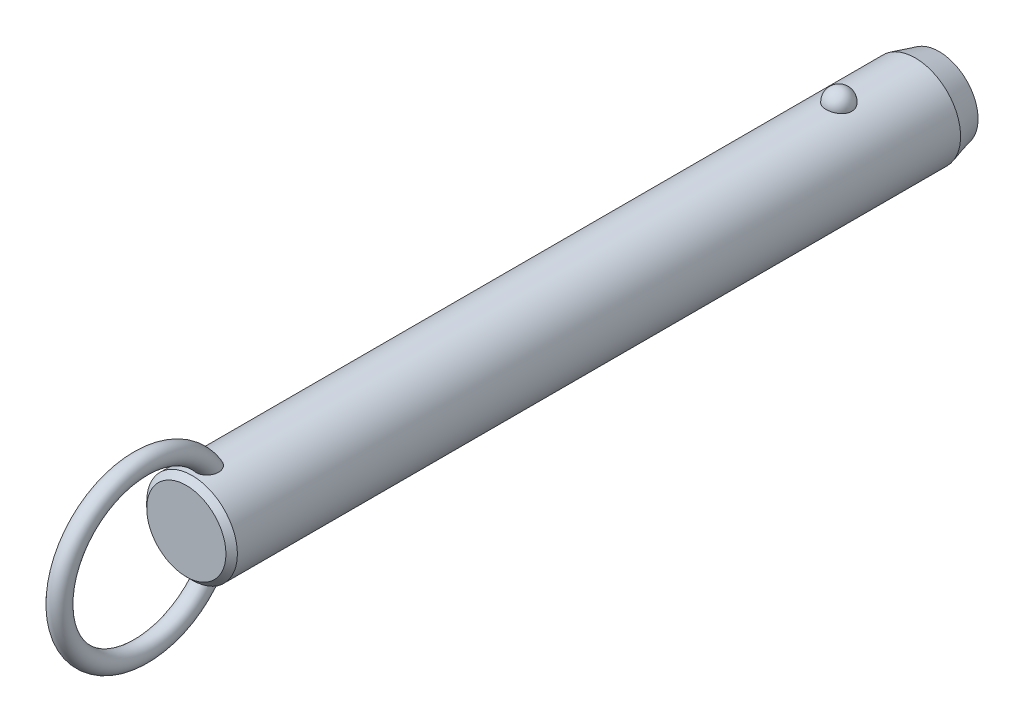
ISO-10303-21;
HEADER;
FILE_DESCRIPTION(('STEP AP214'),'2;1');
FILE_NAME('part.step','',(''),(''),'','','');
FILE_SCHEMA(('AUTOMOTIVE_DESIGN { 1 0 10303 214 1 1 1 1 }'));
ENDSEC;
DATA;
#1=APPLICATION_CONTEXT('core data for automotive mechanical design processes');
#2=APPLICATION_PROTOCOL_DEFINITION('international standard','automotive_design',2000,#1);
#3=PRODUCT_CONTEXT('',#1,'mechanical');
#4=PRODUCT('Part','Part','',(#3));
#5=PRODUCT_RELATED_PRODUCT_CATEGORY('part','',(#4));
#6=PRODUCT_DEFINITION_FORMATION('','',#4);
#7=PRODUCT_DEFINITION_CONTEXT('part definition',#1,'design');
#8=PRODUCT_DEFINITION('design','',#6,#7);
#9=PRODUCT_DEFINITION_SHAPE('','',#8);
#10=(LENGTH_UNIT() NAMED_UNIT(*) SI_UNIT(.MILLI.,.METRE.));
#11=(NAMED_UNIT(*) PLANE_ANGLE_UNIT() SI_UNIT($,.RADIAN.));
#12=(NAMED_UNIT(*) SI_UNIT($,.STERADIAN.) SOLID_ANGLE_UNIT());
#13=UNCERTAINTY_MEASURE_WITH_UNIT(LENGTH_MEASURE(1.E-05),#10,'distance_accuracy_value','');
#14=(GEOMETRIC_REPRESENTATION_CONTEXT(3) GLOBAL_UNCERTAINTY_ASSIGNED_CONTEXT((#13)) GLOBAL_UNIT_ASSIGNED_CONTEXT((#10,
#11,#12)) REPRESENTATION_CONTEXT('',''));
#15=CARTESIAN_POINT('',(0.,0.,0.));
#16=DIRECTION('',(0.,0.,1.));
#17=DIRECTION('',(1.,0.,0.));
#18=AXIS2_PLACEMENT_3D('',#15,#16,#17);
#19=CARTESIAN_POINT('',(0.,0.,124.5));
#20=DIRECTION('',(0.,0.,-1.));
#21=DIRECTION('',(-1.,0.,0.));
#22=AXIS2_PLACEMENT_3D('',#19,#20,#21);
#23=CYLINDRICAL_SURFACE('',#22,9.5);
#24=CARTESIAN_POINT('',(2.67259918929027,9.11631578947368,-2.70000000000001));
#25=CARTESIAN_POINT('',(2.6725968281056,9.11631786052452,-2.54909854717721));
#26=CARTESIAN_POINT('',(2.66030567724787,9.11994722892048,-2.39816735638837));
#27=CARTESIAN_POINT('',(2.6114347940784,9.13405924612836,-2.10058568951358));
#28=CARTESIAN_POINT('',(2.57484658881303,9.14454428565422,-1.95393672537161));
#29=CARTESIAN_POINT('',(2.47830875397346,9.17117631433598,-1.66916069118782));
#30=CARTESIAN_POINT('',(2.41836936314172,9.18732082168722,-1.53102991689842));
#31=CARTESIAN_POINT('',(2.27661331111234,9.22346780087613,-1.26705393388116));
#32=CARTESIAN_POINT('',(2.19479699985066,9.24347021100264,-1.14120852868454));
#33=CARTESIAN_POINT('',(2.01085282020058,9.28522401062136,-0.904632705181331));
#34=CARTESIAN_POINT('',(1.90862396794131,9.30698376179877,-0.793982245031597));
#35=CARTESIAN_POINT('',(1.6867437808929,9.34973971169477,-0.591607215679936));
#36=CARTESIAN_POINT('',(1.56709244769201,9.37073591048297,-0.499882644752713));
#37=CARTESIAN_POINT('',(1.31393976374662,9.40956370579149,-0.338167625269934));
#38=CARTESIAN_POINT('',(1.18048026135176,9.42740444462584,-0.268113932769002));
#39=CARTESIAN_POINT('',(0.903154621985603,9.45799906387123,-0.151390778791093));
#40=CARTESIAN_POINT('',(0.759289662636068,9.47075351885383,-0.104718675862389));
#41=CARTESIAN_POINT('',(0.468074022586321,9.48956256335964,-0.0367633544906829));
#42=CARTESIAN_POINT('',(0.320836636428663,9.49573643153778,-0.0150275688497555));
#43=CARTESIAN_POINT('',(0.0246714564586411,9.50112183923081,0.00396199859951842));
#44=CARTESIAN_POINT('',(-0.124256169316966,9.50033406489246,0.00121819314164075));
#45=CARTESIAN_POINT('',(-0.417264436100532,9.4919475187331,-0.0284441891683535));
#46=CARTESIAN_POINT('',(-0.56138413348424,9.48444885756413,-0.0550074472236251));
#47=CARTESIAN_POINT('',(-0.842986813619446,9.46357853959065,-0.131064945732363));
#48=CARTESIAN_POINT('',(-0.980469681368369,9.450206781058,-0.180559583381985));
#49=CARTESIAN_POINT('',(-1.24585005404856,9.41890822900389,-0.301476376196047));
#50=CARTESIAN_POINT('',(-1.37368611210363,9.40095498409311,-0.373026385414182));
#51=CARTESIAN_POINT('',(-1.61552738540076,9.36242964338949,-0.536025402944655));
#52=CARTESIAN_POINT('',(-1.72953116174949,9.34185727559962,-0.627476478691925));
#53=CARTESIAN_POINT('',(-1.9429225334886,9.29984568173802,-0.829844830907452));
#54=CARTESIAN_POINT('',(-2.04198021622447,9.27839736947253,-0.94110821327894));
#55=CARTESIAN_POINT('',(-2.22026460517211,9.23735994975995,-1.17883414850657));
#56=CARTESIAN_POINT('',(-2.29948985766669,9.21777097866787,-1.30529781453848));
#57=CARTESIAN_POINT('',(-2.43697287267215,9.18238994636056,-1.57158566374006));
#58=CARTESIAN_POINT('',(-2.49497068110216,9.16664569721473,-1.71155057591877));
#59=CARTESIAN_POINT('',(-2.5872073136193,9.14104303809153,-1.99961197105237));
#60=CARTESIAN_POINT('',(-2.62144683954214,9.13118445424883,-2.14770821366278));
#61=CARTESIAN_POINT('',(-2.66521466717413,9.11850622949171,-2.44715424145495));
#62=CARTESIAN_POINT('',(-2.67484831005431,9.11565658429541,-2.59848735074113));
#63=CARTESIAN_POINT('',(-2.66946735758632,9.11723375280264,-2.90067317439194));
#64=CARTESIAN_POINT('',(-2.65445345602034,9.12166036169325,-3.05152590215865));
#65=CARTESIAN_POINT('',(-2.60029711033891,9.13724422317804,-3.34766110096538));
#66=CARTESIAN_POINT('',(-2.56127978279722,9.14836656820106,-3.49296833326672));
#67=CARTESIAN_POINT('',(-2.46018844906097,9.17606676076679,-3.77477535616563));
#68=CARTESIAN_POINT('',(-2.39811349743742,9.1926448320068,-3.9112747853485));
#69=CARTESIAN_POINT('',(-2.25202303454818,9.22952198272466,-4.17244273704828));
#70=CARTESIAN_POINT('',(-2.16788714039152,9.24984129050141,-4.29704106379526));
#71=CARTESIAN_POINT('',(-1.9799408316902,9.29188255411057,-4.53013066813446));
#72=CARTESIAN_POINT('',(-1.87612963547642,9.31360456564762,-4.63862130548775));
#73=CARTESIAN_POINT('',(-1.65105429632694,9.35612959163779,-4.8369029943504));
#74=CARTESIAN_POINT('',(-1.52972405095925,9.37692871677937,-4.92661991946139));
#75=CARTESIAN_POINT('',(-1.27318250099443,9.41518970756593,-5.08429106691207));
#76=CARTESIAN_POINT('',(-1.13797219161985,9.432651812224,-5.15224684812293));
#77=CARTESIAN_POINT('',(-0.859280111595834,9.46208255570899,-5.26371827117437));
#78=CARTESIAN_POINT('',(-0.715925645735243,9.47411833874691,-5.30753421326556));
#79=CARTESIAN_POINT('',(-0.423550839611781,9.4916822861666,-5.37076321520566));
#80=CARTESIAN_POINT('',(-0.2745312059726,9.49721125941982,-5.39017930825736));
#81=CARTESIAN_POINT('',(0.0218446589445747,9.50110860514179,-5.40390587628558));
#82=CARTESIAN_POINT('',(0.16917707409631,9.49961381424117,-5.39869609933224));
#83=CARTESIAN_POINT('',(0.460808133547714,9.48993906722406,-5.36441955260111));
#84=CARTESIAN_POINT('',(0.605106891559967,9.48175936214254,-5.33535367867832));
#85=CARTESIAN_POINT('',(0.886027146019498,9.4596376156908,-5.25435587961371));
#86=CARTESIAN_POINT('',(1.02267710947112,9.44571881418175,-5.20251612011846));
#87=CARTESIAN_POINT('',(1.28523827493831,9.41358993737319,-5.07741549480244));
#88=CARTESIAN_POINT('',(1.41114877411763,9.39537958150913,-5.00415322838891));
#89=CARTESIAN_POINT('',(1.65085227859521,9.3562644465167,-4.83684599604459));
#90=CARTESIAN_POINT('',(1.76442346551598,9.33532178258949,-4.74249218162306));
#91=CARTESIAN_POINT('',(1.97425672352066,9.29321198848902,-4.53620389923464));
#92=CARTESIAN_POINT('',(2.07051582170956,9.27204482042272,-4.42426641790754));
#93=CARTESIAN_POINT('',(2.24490086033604,9.23139221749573,-4.18363183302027));
#94=CARTESIAN_POINT('',(2.32267019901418,9.21194380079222,-4.05466990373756));
#95=CARTESIAN_POINT('',(2.45584092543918,9.1773419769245,-3.78517836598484));
#96=CARTESIAN_POINT('',(2.5112497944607,9.16218713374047,-3.64465264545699));
#97=CARTESIAN_POINT('',(2.59380876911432,9.13913522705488,-3.37104301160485));
#98=CARTESIAN_POINT('',(2.62330266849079,9.13064624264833,-3.23871053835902));
#99=CARTESIAN_POINT('',(2.66269870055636,9.11923566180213,-2.97092664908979));
#100=CARTESIAN_POINT('',(2.67260130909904,9.11631393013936,-2.83547530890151));
#101=CARTESIAN_POINT('',(2.67259918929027,9.11631578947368,-2.70000000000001));
#102=B_SPLINE_CURVE_WITH_KNOTS('',3,(#24,#25,#26,#27,#28,#29,#30,#31,#32,#33,#34,#35,#36,#37,
#38,#39,#40,#41,#42,#43,#44,#45,#46,#47,#48,#49,#50,#51,#52,#53,#54,#55,#56,#57,#58,#59,#60,#61,
#62,#63,#64,#65,#66,#67,#68,#69,#70,#71,#72,#73,#74,#75,#76,#77,#78,#79,#80,#81,#82,#83,#84,#85,
#86,#87,#88,#89,#90,#91,#92,#93,#94,#95,#96,#97,#98,#99,#100,#101),.UNSPECIFIED.,.T.,.F.,(4,2,2,
2,2,2,2,2,2,2,2,2,2,2,2,2,2,2,2,2,2,2,2,2,2,2,2,2,2,2,2,2,2,2,2,2,2,2,4),(0.,0.452217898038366,
0.904593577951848,1.35677112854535,1.80894144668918,2.26340676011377,2.71787203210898,
3.17099820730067,3.62407318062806,4.0687883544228,4.51345969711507,4.95160616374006,
5.38976021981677,5.83050358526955,6.27129275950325,6.72071308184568,7.17016633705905,
7.62495278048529,8.07972578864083,8.53254856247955,8.98535859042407,9.43582813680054,
9.88631615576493,10.3393155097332,10.7923328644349,11.2471065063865,11.7018475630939,
12.150795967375,12.599688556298,13.0398725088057,13.4800399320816,13.9184421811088,
14.3568730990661,14.802202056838,15.2476074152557,15.7010097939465,16.1542603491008,
16.5602594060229,16.966248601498),.UNSPECIFIED.);
#103=CARTESIAN_POINT('',(2.67259918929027,9.11631578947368,-2.70000000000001));
#104=VERTEX_POINT('',#103);
#105=EDGE_CURVE('E41',#104,#104,#102,.T.);
#106=ORIENTED_EDGE('',*,*,#105,.T.);
#107=EDGE_LOOP('',(#106));
#108=FACE_BOUND('',#107,.T.);
#109=CARTESIAN_POINT('',(0.,0.,132.82));
#110=DIRECTION('',(0.,0.,1.));
#111=DIRECTION('',(1.,0.,0.));
#112=AXIS2_PLACEMENT_3D('',#109,#110,#111);
#113=CIRCLE('',#112,9.5);
#114=CARTESIAN_POINT('',(9.5,0.,132.82));
#115=VERTEX_POINT('',#114);
#116=EDGE_CURVE('E10',#115,#115,#113,.F.);
#117=ORIENTED_EDGE('',*,*,#116,.T.);
#118=EDGE_LOOP('',(#117));
#119=FACE_BOUND('',#118,.T.);
#120=CARTESIAN_POINT('',(-0.697062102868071,-9.47439269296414,127.167808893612));
#121=CARTESIAN_POINT('',(-0.799579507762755,-9.46685146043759,127.207482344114));
#122=CARTESIAN_POINT('',(-0.898575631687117,-9.45788043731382,127.2559309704));
#123=CARTESIAN_POINT('',(-1.08670047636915,-9.43811593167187,127.368868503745));
#124=CARTESIAN_POINT('',(-1.17583204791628,-9.42732297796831,127.433352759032));
#125=CARTESIAN_POINT('',(-1.34179806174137,-9.40513672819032,127.576209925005));
#126=CARTESIAN_POINT('',(-1.41865133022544,-9.39374438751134,127.654561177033));
#127=CARTESIAN_POINT('',(-1.55860047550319,-9.37154196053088,127.822752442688));
#128=CARTESIAN_POINT('',(-1.62169476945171,-9.3607319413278,127.91259377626));
#129=CARTESIAN_POINT('',(-1.73527695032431,-9.34035749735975,128.104500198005));
#130=CARTESIAN_POINT('',(-1.78522266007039,-9.33085270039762,128.206891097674));
#131=CARTESIAN_POINT('',(-1.86924997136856,-9.3143834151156,128.418148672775));
#132=CARTESIAN_POINT('',(-1.90332570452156,-9.30741986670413,128.527017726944));
#133=CARTESIAN_POINT('',(-1.95893603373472,-9.29588482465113,128.760473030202));
#134=CARTESIAN_POINT('',(-1.97872420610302,-9.29165182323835,128.885489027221));
#135=CARTESIAN_POINT('',(-2.00062129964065,-9.28695978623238,129.137080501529));
#136=CARTESIAN_POINT('',(-2.00272284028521,-9.28650232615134,129.263656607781));
#137=CARTESIAN_POINT('',(-1.98958876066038,-9.28932750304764,129.536815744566));
#138=CARTESIAN_POINT('',(-1.97143366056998,-9.2932400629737,129.683251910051));
#139=CARTESIAN_POINT('',(-1.91479925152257,-9.30507151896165,129.972062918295));
#140=CARTESIAN_POINT('',(-1.87629122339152,-9.31299607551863,130.114431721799));
#141=CARTESIAN_POINT('',(-1.77225683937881,-9.33340232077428,130.415172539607));
#142=CARTESIAN_POINT('',(-1.70334898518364,-9.34641636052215,130.572369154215));
#143=CARTESIAN_POINT('',(-1.58111062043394,-9.36759153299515,130.797517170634));
#144=CARTESIAN_POINT('',(-1.53721459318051,-9.37492619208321,130.870796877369));
#145=CARTESIAN_POINT('',(-1.4430263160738,-9.38988566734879,131.01307405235));
#146=CARTESIAN_POINT('',(-1.39273721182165,-9.39751033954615,131.082073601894));
#147=CARTESIAN_POINT('',(-1.26775962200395,-9.41530678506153,131.236983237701));
#148=CARTESIAN_POINT('',(-1.19052326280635,-9.42548108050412,131.320871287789));
#149=CARTESIAN_POINT('',(-1.02420241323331,-9.44499825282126,131.476008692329));
#150=CARTESIAN_POINT('',(-0.93513986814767,-9.45434261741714,131.547280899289));
#151=CARTESIAN_POINT('',(-0.766610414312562,-9.46930670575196,131.658695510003));
#152=CARTESIAN_POINT('',(-0.689439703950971,-9.47529223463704,131.702235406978));
#153=CARTESIAN_POINT('',(-0.528942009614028,-9.48560294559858,131.77631336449));
#154=CARTESIAN_POINT('',(-0.445620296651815,-9.48992953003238,131.806862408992));
#155=CARTESIAN_POINT('',(-0.273901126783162,-9.49644161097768,131.852579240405));
#156=CARTESIAN_POINT('',(-0.18546574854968,-9.49860811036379,131.86761059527));
#157=CARTESIAN_POINT('',(-0.00734541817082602,-9.5004135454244,131.880149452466));
#158=CARTESIAN_POINT('',(0.0823387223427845,-9.50005405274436,131.877667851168));
#159=CARTESIAN_POINT('',(0.24767927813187,-9.49708301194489,131.856995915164));
#160=CARTESIAN_POINT('',(0.323620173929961,-9.49477609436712,131.840930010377));
#161=CARTESIAN_POINT('',(0.471981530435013,-9.48855917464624,131.797172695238));
#162=CARTESIAN_POINT('',(0.544400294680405,-9.48464840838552,131.769475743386));
#163=CARTESIAN_POINT('',(0.708947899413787,-9.47398336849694,131.69280266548));
#164=CARTESIAN_POINT('',(0.799149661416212,-9.46671310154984,131.639774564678));
#165=CARTESIAN_POINT('',(0.969783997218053,-9.45076225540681,131.519973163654));
#166=CARTESIAN_POINT('',(1.050194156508,-9.44207854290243,131.453169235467));
#167=CARTESIAN_POINT('',(1.23092343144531,-9.42051459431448,131.280759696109));
#168=CARTESIAN_POINT('',(1.32652499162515,-9.40733378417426,131.17026193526));
#169=CARTESIAN_POINT('',(1.49893121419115,-9.38140745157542,130.935561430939));
#170=CARTESIAN_POINT('',(1.5757161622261,-9.36866239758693,130.811344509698));
#171=CARTESIAN_POINT('',(1.71285426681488,-9.34457644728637,130.549389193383));
#172=CARTESIAN_POINT('',(1.77266365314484,-9.33328726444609,130.41136233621));
#173=CARTESIAN_POINT('',(1.87239208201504,-9.31379209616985,130.128051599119));
#174=CARTESIAN_POINT('',(1.91230158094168,-9.3055875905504,129.982764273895));
#175=CARTESIAN_POINT('',(1.97604189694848,-9.29228394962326,129.662028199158));
#176=CARTESIAN_POINT('',(1.9958743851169,-9.28797202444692,129.485724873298));
#177=CARTESIAN_POINT('',(2.0029570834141,-9.28645519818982,129.132414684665));
#178=CARTESIAN_POINT('',(1.99025930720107,-9.28923895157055,128.955409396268));
#179=CARTESIAN_POINT('',(1.93735479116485,-9.30038134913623,128.656338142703));
#180=CARTESIAN_POINT('',(1.90576827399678,-9.30697680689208,128.532667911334));
#181=CARTESIAN_POINT('',(1.8228748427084,-9.32356855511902,128.292329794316));
#182=CARTESIAN_POINT('',(1.77158213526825,-9.33356239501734,128.175656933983));
#183=CARTESIAN_POINT('',(1.64885744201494,-9.35602275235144,127.952706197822));
#184=CARTESIAN_POINT('',(1.57730995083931,-9.36850332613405,127.846492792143));
#185=CARTESIAN_POINT('',(1.41543264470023,-9.39431873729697,127.649553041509));
#186=CARTESIAN_POINT('',(1.32510883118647,-9.40765330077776,127.558821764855));
#187=CARTESIAN_POINT('',(1.13846223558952,-9.43195720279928,127.405033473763));
#188=CARTESIAN_POINT('',(1.04369890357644,-9.44302894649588,127.340094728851));
#189=CARTESIAN_POINT('',(0.843965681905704,-9.46296805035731,127.228038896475));
#190=CARTESIAN_POINT('',(0.739000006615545,-9.47183631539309,127.180914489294));
#191=CARTESIAN_POINT('',(0.528175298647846,-9.48586140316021,127.108117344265));
#192=CARTESIAN_POINT('',(0.422686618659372,-9.49119633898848,127.08140249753));
#193=CARTESIAN_POINT('',(0.208590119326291,-9.49831365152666,127.046013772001));
#194=CARTESIAN_POINT('',(0.0999817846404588,-9.500095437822,127.037342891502));
#195=CARTESIAN_POINT('',(-0.126104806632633,-9.49988861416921,127.038350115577));
#196=CARTESIAN_POINT('',(-0.243578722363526,-9.49757821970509,127.049594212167));
#197=CARTESIAN_POINT('',(-0.474390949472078,-9.48885165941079,127.093167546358));
#198=CARTESIAN_POINT('',(-0.587729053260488,-9.48243528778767,127.125497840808));
#199=CARTESIAN_POINT('',(-0.697062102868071,-9.47439269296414,127.167808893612));
#200=B_SPLINE_CURVE_WITH_KNOTS('',3,(#120,#121,#122,#123,#124,#125,#126,#127,#128,#129,#130,
#131,#132,#133,#134,#135,#136,#137,#138,#139,#140,#141,#142,#143,#144,#145,#146,#147,#148,#149,
#150,#151,#152,#153,#154,#155,#156,#157,#158,#159,#160,#161,#162,#163,#164,#165,#166,#167,#168,
#169,#170,#171,#172,#173,#174,#175,#176,#177,#178,#179,#180,#181,#182,#183,#184,#185,#186,#187,
#188,#189,#190,#191,#192,#193,#194,#195,#196,#197,#198,#199),.UNSPECIFIED.,.T.,.F.,(4,2,2,2,2,2,
2,2,2,2,2,2,2,2,2,2,2,2,2,2,2,2,2,2,2,2,2,2,2,2,2,2,2,2,2,2,2,2,2,4),(0.,0.330119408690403,
0.660143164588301,0.989655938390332,1.31920659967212,1.66074728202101,2.00241415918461,
2.38088696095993,2.75951768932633,3.20065679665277,3.64242004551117,4.15620996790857,
4.4131416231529,4.66994734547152,5.01228664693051,5.35399933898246,5.61943037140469,
5.88463652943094,6.15215502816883,6.4195070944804,6.65144391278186,6.88349136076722,
7.19641200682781,7.51003602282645,7.94779711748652,8.3860149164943,8.83699707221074,
9.28819530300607,9.81778662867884,10.34653170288,10.7284172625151,11.1100280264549,
11.4938603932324,11.8775702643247,12.2220189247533,12.5663259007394,12.8915939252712,
13.2169159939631,13.5689650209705,13.9210316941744),.UNSPECIFIED.);
#201=CARTESIAN_POINT('',(-0.697062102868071,-9.47439269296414,127.167808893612));
#202=VERTEX_POINT('',#201);
#203=EDGE_CURVE('E59',#202,#202,#200,.T.);
#204=ORIENTED_EDGE('',*,*,#203,.T.);
#205=EDGE_LOOP('',(#204));
#206=FACE_BOUND('',#205,.T.);
#207=CARTESIAN_POINT('',(-0.697062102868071,9.47439269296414,127.167808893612));
#208=CARTESIAN_POINT('',(-0.597792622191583,9.48169483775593,127.12939564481));
#209=CARTESIAN_POINT('',(-0.495106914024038,9.48766580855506,127.099168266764));
#210=CARTESIAN_POINT('',(-0.285876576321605,9.49627648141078,127.056032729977));
#211=CARTESIAN_POINT('',(-0.179324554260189,9.49890941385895,127.043159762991));
#212=CARTESIAN_POINT('',(0.0344157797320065,9.50053798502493,127.035166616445));
#213=CARTESIAN_POINT('',(0.141603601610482,9.49953613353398,127.040034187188));
#214=CARTESIAN_POINT('',(0.35356357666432,9.49401038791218,127.067365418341));
#215=CARTESIAN_POINT('',(0.458336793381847,9.48948807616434,127.08982117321));
#216=CARTESIAN_POINT('',(0.662493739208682,9.4774236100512,127.151671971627));
#217=CARTESIAN_POINT('',(0.761881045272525,9.46988348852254,127.191055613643));
#218=CARTESIAN_POINT('',(0.952608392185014,9.45260382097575,127.285634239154));
#219=CARTESIAN_POINT('',(1.04394806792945,9.44286417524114,127.340829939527));
#220=CARTESIAN_POINT('',(1.21712767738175,9.42211760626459,127.466066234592));
#221=CARTESIAN_POINT('',(1.29885671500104,9.41109835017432,127.536257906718));
#222=CARTESIAN_POINT('',(1.44978975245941,9.38903310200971,127.688980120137));
#223=CARTESIAN_POINT('',(1.51899278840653,9.37798710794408,127.771511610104));
#224=CARTESIAN_POINT('',(1.64602857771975,9.35654375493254,127.949776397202));
#225=CARTESIAN_POINT('',(1.70333052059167,9.34618688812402,128.045891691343));
#226=CARTESIAN_POINT('',(1.80259341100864,9.32755128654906,128.245897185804));
#227=CARTESIAN_POINT('',(1.84454942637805,9.31927322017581,128.349789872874));
#228=CARTESIAN_POINT('',(1.91637039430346,9.30478365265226,128.572213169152));
#229=CARTESIAN_POINT('',(1.944805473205,9.29882552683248,128.691219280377));
#230=CARTESIAN_POINT('',(1.98449865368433,9.29043398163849,128.932143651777));
#231=CARTESIAN_POINT('',(1.99574908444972,9.28800213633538,129.054063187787));
#232=CARTESIAN_POINT('',(2.00275141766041,9.28649645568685,129.316932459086));
#233=CARTESIAN_POINT('',(1.99588238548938,9.28799035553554,129.457952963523));
#234=CARTESIAN_POINT('',(1.96270559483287,9.29505517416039,129.737621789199));
#235=CARTESIAN_POINT('',(1.93637872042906,9.30063010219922,129.876267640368));
#236=CARTESIAN_POINT('',(1.85949176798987,9.31633564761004,130.172561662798));
#237=CARTESIAN_POINT('',(1.80549792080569,9.3270926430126,130.329290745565));
#238=CARTESIAN_POINT('',(1.67376869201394,9.3516306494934,130.632284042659));
#239=CARTESIAN_POINT('',(1.59603181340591,9.36541185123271,130.778547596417));
#240=CARTESIAN_POINT('',(1.4360277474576,9.39110706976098,131.025813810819));
#241=CARTESIAN_POINT('',(1.35831795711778,9.40278656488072,131.129791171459));
#242=CARTESIAN_POINT('',(1.18774483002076,9.42585025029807,131.324534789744));
#243=CARTESIAN_POINT('',(1.09490932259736,9.43723493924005,131.415324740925));
#244=CARTESIAN_POINT('',(0.92111037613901,9.45552616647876,131.55620334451));
#245=CARTESIAN_POINT('',(0.84373824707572,9.46281058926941,131.610656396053));
#246=CARTESIAN_POINT('',(0.681245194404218,9.47589120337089,131.706711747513));
#247=CARTESIAN_POINT('',(0.596135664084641,9.48168953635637,131.748332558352));
#248=CARTESIAN_POINT('',(0.433779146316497,9.49038144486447,131.810089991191));
#249=CARTESIAN_POINT('',(0.357459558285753,9.49359170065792,131.83260136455));
#250=CARTESIAN_POINT('',(0.202074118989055,9.49816761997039,131.864574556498));
#251=CARTESIAN_POINT('',(0.123010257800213,9.49953459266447,131.874045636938));
#252=CARTESIAN_POINT('',(-0.0357372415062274,9.50026497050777,131.879114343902));
#253=CARTESIAN_POINT('',(-0.115421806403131,9.49962433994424,131.874684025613));
#254=CARTESIAN_POINT('',(-0.272823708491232,9.49640854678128,131.852296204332));
#255=CARTESIAN_POINT('',(-0.350540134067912,9.4938325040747,131.834332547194));
#256=CARTESIAN_POINT('',(-0.500580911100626,9.48709462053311,131.786802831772));
#257=CARTESIAN_POINT('',(-0.572979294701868,9.48296359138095,131.757461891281));
#258=CARTESIAN_POINT('',(-0.712864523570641,9.47347609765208,131.689008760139));
#259=CARTESIAN_POINT('',(-0.780349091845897,9.46811906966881,131.649892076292));
#260=CARTESIAN_POINT('',(-0.946309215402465,9.45329720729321,131.539432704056));
#261=CARTESIAN_POINT('',(-1.04090230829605,9.44321512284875,131.462329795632));
#262=CARTESIAN_POINT('',(-1.21661929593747,9.42219227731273,131.29409718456));
#263=CARTESIAN_POINT('',(-1.29770519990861,9.41124921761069,131.202929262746));
#264=CARTESIAN_POINT('',(-1.47319646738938,9.38563439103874,130.976162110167));
#265=CARTESIAN_POINT('',(-1.56208878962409,9.37102009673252,130.836289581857));
#266=CARTESIAN_POINT('',(-1.71623987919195,9.34401559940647,130.543950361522));
#267=CARTESIAN_POINT('',(-1.78147866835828,9.33162728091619,130.391473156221));
#268=CARTESIAN_POINT('',(-1.88853837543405,9.31055541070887,130.075647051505));
#269=CARTESIAN_POINT('',(-1.92998995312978,9.30193076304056,129.912168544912));
#270=CARTESIAN_POINT('',(-1.98590726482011,9.29015757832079,129.580526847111));
#271=CARTESIAN_POINT('',(-2.0004070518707,9.2870021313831,129.412369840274));
#272=CARTESIAN_POINT('',(-1.99964701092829,9.28716218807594,129.105080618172));
#273=CARTESIAN_POINT('',(-1.98908145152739,9.28945704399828,128.965936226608));
#274=CARTESIAN_POINT('',(-1.94566294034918,9.29865169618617,128.691153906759));
#275=CARTESIAN_POINT('',(-1.9128206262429,9.30554929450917,128.555514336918));
#276=CARTESIAN_POINT('',(-1.84582133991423,9.31898248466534,128.357802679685));
#277=CARTESIAN_POINT('',(-1.82038084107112,9.32400364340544,128.292583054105));
#278=CARTESIAN_POINT('',(-1.76350511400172,9.33492884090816,128.164903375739));
#279=CARTESIAN_POINT('',(-1.73207305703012,9.34083241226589,128.102441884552));
#280=CARTESIAN_POINT('',(-1.66324243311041,9.35333332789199,127.98094078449));
#281=CARTESIAN_POINT('',(-1.62584239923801,9.35993084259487,127.921902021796));
#282=CARTESIAN_POINT('',(-1.54527678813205,9.37356864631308,127.807987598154));
#283=CARTESIAN_POINT('',(-1.50211241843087,9.38060884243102,127.753111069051));
#284=CARTESIAN_POINT('',(-1.37681147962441,9.40004442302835,127.609961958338));
#285=CARTESIAN_POINT('',(-1.28916358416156,9.41261047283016,127.526429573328));
#286=CARTESIAN_POINT('',(-1.09996826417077,9.43658180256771,127.377236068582));
#287=CARTESIAN_POINT('',(-0.998461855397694,9.44799034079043,127.311523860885));
#288=CARTESIAN_POINT('',(-0.860188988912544,9.46103017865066,127.2394367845));
#289=CARTESIAN_POINT('',(-0.828141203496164,9.46389141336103,127.223851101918));
#290=CARTESIAN_POINT('',(-0.763210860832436,9.46934915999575,127.194473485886));
#291=CARTESIAN_POINT('',(-0.730328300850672,9.47194567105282,127.180681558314));
#292=CARTESIAN_POINT('',(-0.697062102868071,9.47439269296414,127.167808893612));
#293=B_SPLINE_CURVE_WITH_KNOTS('',3,(#207,#208,#209,#210,#211,#212,#213,#214,#215,#216,#217,
#218,#219,#220,#221,#222,#223,#224,#225,#226,#227,#228,#229,#230,#231,#232,#233,#234,#235,#236,
#237,#238,#239,#240,#241,#242,#243,#244,#245,#246,#247,#248,#249,#250,#251,#252,#253,#254,#255,
#256,#257,#258,#259,#260,#261,#262,#263,#264,#265,#266,#267,#268,#269,#270,#271,#272,#273,#274,
#275,#276,#277,#278,#279,#280,#281,#282,#283,#284,#285,#286,#287,#288,#289,#290,#291,#292),
.UNSPECIFIED.,.T.,.F.,(4,2,2,2,2,2,2,2,2,2,2,2,2,2,2,2,2,2,2,2,2,2,2,2,2,2,2,2,2,2,2,2,2,2,2,2,
2,2,2,2,2,2,4),(0.,0.319942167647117,0.640532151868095,0.96090081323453,1.2811255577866,
1.60113495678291,1.92115886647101,2.24457323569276,2.56801248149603,2.90371927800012,
3.23953387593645,3.60560313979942,3.97183576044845,4.39383693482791,4.8162532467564,
5.31257045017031,5.80891895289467,6.19868344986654,6.58773876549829,6.87145417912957,
7.15475838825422,7.39263751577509,7.63034760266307,7.86853584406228,8.10683246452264,
8.3406366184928,8.57454843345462,8.93983939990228,9.30614105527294,9.80266668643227,
10.2996107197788,10.8040753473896,11.3079021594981,11.7249776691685,12.1418541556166,
12.3521485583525,12.5623319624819,12.7725671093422,12.9827582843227,13.345827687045,
13.7078449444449,13.8150604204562,13.9222762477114),.UNSPECIFIED.);
#294=CARTESIAN_POINT('',(-0.697062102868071,9.47439269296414,127.167808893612));
#295=VERTEX_POINT('',#294);
#296=EDGE_CURVE('E67',#295,#295,#293,.T.);
#297=ORIENTED_EDGE('',*,*,#296,.T.);
#298=EDGE_LOOP('',(#297));
#299=FACE_BOUND('',#298,.T.);
#300=CARTESIAN_POINT('',(0.,0.,-18.6999999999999));
#301=DIRECTION('',(0.,0.,-1.));
#302=DIRECTION('',(-1.,0.,0.));
#303=AXIS2_PLACEMENT_3D('',#300,#301,#302);
#304=CIRCLE('',#303,9.5);
#305=CARTESIAN_POINT('',(-9.5,0.,-18.6999999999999));
#306=VERTEX_POINT('',#305);
#307=EDGE_CURVE('E56',#306,#306,#304,.F.);
#308=ORIENTED_EDGE('',*,*,#307,.T.);
#309=EDGE_LOOP('',(#308));
#310=FACE_BOUND('',#309,.T.);
#311=ADVANCED_FACE('F37',(#108,#119,#206,#299,#310),#23,.T.);
#312=CARTESIAN_POINT('',(0.,0.,-23.7));
#313=DIRECTION('',(0.,0.,-1.));
#314=DIRECTION('',(-1.,0.,0.));
#315=AXIS2_PLACEMENT_3D('',#312,#313,#314);
#316=PLANE('',#315);
#317=CARTESIAN_POINT('',(0.,0.,-23.7));
#318=DIRECTION('',(0.,0.,-1.));
#319=DIRECTION('',(-1.,0.,0.));
#320=AXIS2_PLACEMENT_3D('',#317,#318,#319);
#321=CIRCLE('',#320,8.16025403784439);
#322=CARTESIAN_POINT('',(-8.16025403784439,0.,-23.7));
#323=VERTEX_POINT('',#322);
#324=EDGE_CURVE('E66',#323,#323,#321,.T.);
#325=ORIENTED_EDGE('',*,*,#324,.T.);
#326=EDGE_LOOP('',(#325));
#327=FACE_BOUND('',#326,.T.);
#328=ADVANCED_FACE('F85',(#327),#316,.T.);
#329=CARTESIAN_POINT('',(0.,0.,-23.7));
#330=DIRECTION('',(0.,0.,1.));
#331=DIRECTION('',(1.,0.,0.));
#332=AXIS2_PLACEMENT_3D('',#329,#330,#331);
#333=CONICAL_SURFACE('',#332,8.16025403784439,0.261799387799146);
#334=ORIENTED_EDGE('',*,*,#307,.F.);
#335=EDGE_LOOP('',(#334));
#336=FACE_BOUND('',#335,.T.);
#337=ORIENTED_EDGE('',*,*,#324,.F.);
#338=EDGE_LOOP('',(#337));
#339=FACE_BOUND('',#338,.T.);
#340=ADVANCED_FACE('F83',(#336,#339),#333,.T.);
#341=CARTESIAN_POINT('',(0.,0.,134.02));
#342=DIRECTION('',(0.,0.,1.));
#343=DIRECTION('',(1.,0.,0.));
#344=AXIS2_PLACEMENT_3D('',#341,#342,#343);
#345=PLANE('',#344);
#346=CARTESIAN_POINT('',(0.,0.,134.02));
#347=DIRECTION('',(0.,0.,1.));
#348=DIRECTION('',(1.,0.,0.));
#349=AXIS2_PLACEMENT_3D('',#346,#347,#348);
#350=CIRCLE('',#349,8.30000000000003);
#351=CARTESIAN_POINT('',(8.30000000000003,0.,134.02));
#352=VERTEX_POINT('',#351);
#353=EDGE_CURVE('E50',#352,#352,#350,.T.);
#354=ORIENTED_EDGE('',*,*,#353,.T.);
#355=EDGE_LOOP('',(#354));
#356=FACE_BOUND('',#355,.T.);
#357=ADVANCED_FACE('F77',(#356),#345,.T.);
#358=CARTESIAN_POINT('',(0.,0.,143.55));
#359=DIRECTION('',(1.,0.,0.));
#360=DIRECTION('',(0.,0.,-1.));
#361=AXIS2_PLACEMENT_3D('',#358,#359,#360);
#362=TOROIDAL_SURFACE('',#361,17.05,2.);
#363=ORIENTED_EDGE('',*,*,#296,.F.);
#364=EDGE_LOOP('',(#363));
#365=FACE_BOUND('',#364,.T.);
#366=ORIENTED_EDGE('',*,*,#203,.F.);
#367=EDGE_LOOP('',(#366));
#368=FACE_BOUND('',#367,.T.);
#369=ADVANCED_FACE('F73',(#365,#368),#362,.T.);
#370=CARTESIAN_POINT('',(0.,0.,134.02));
#371=DIRECTION('',(0.,0.,-1.));
#372=DIRECTION('',(-1.,0.,0.));
#373=AXIS2_PLACEMENT_3D('',#370,#371,#372);
#374=CONICAL_SURFACE('',#373,8.30000000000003,0.785398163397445);
#375=ORIENTED_EDGE('',*,*,#116,.F.);
#376=EDGE_LOOP('',(#375));
#377=FACE_BOUND('',#376,.T.);
#378=ORIENTED_EDGE('',*,*,#353,.F.);
#379=EDGE_LOOP('',(#378));
#380=FACE_BOUND('',#379,.T.);
#381=ADVANCED_FACE('F39',(#377,#380),#374,.T.);
#382=CARTESIAN_POINT('',(0.,9.5,-2.70000000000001));
#383=DIRECTION('',(0.,1.,0.));
#384=DIRECTION('',(0.,0.,-1.));
#385=AXIS2_PLACEMENT_3D('',#382,#383,#384);
#386=SPHERICAL_SURFACE('',#385,2.7);
#387=ORIENTED_EDGE('',*,*,#105,.F.);
#388=EDGE_LOOP('',(#387));
#389=FACE_BOUND('',#388,.T.);
#390=ADVANCED_FACE('F79',(#389),#386,.T.);
#391=CLOSED_SHELL('',(#311,#328,#340,#357,#369,#381,#390));
#392=MANIFOLD_SOLID_BREP('B2',#391);
#393=ADVANCED_BREP_SHAPE_REPRESENTATION('',(#18,#392),#14);
#394=SHAPE_DEFINITION_REPRESENTATION(#9,#393);
ENDSEC;
END-ISO-10303-21;
